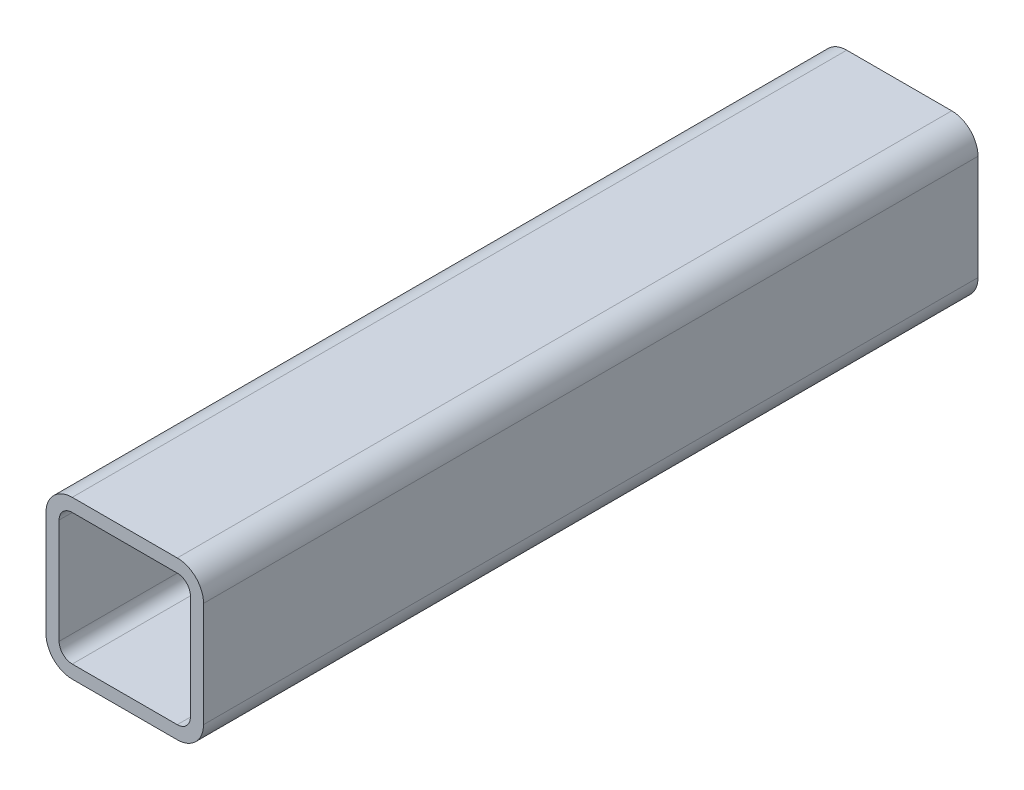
ISO-10303-21;
HEADER;
FILE_DESCRIPTION(('STEP AP214'),'2;1');
FILE_NAME('part.step','',(''),(''),'','','');
FILE_SCHEMA(('AUTOMOTIVE_DESIGN { 1 0 10303 214 1 1 1 1 }'));
ENDSEC;
DATA;
#1=APPLICATION_CONTEXT('core data for automotive mechanical design processes');
#2=APPLICATION_PROTOCOL_DEFINITION('international standard','automotive_design',2000,#1);
#3=PRODUCT_CONTEXT('',#1,'mechanical');
#4=PRODUCT('Part','Part','',(#3));
#5=PRODUCT_RELATED_PRODUCT_CATEGORY('part','',(#4));
#6=PRODUCT_DEFINITION_FORMATION('','',#4);
#7=PRODUCT_DEFINITION_CONTEXT('part definition',#1,'design');
#8=PRODUCT_DEFINITION('design','',#6,#7);
#9=PRODUCT_DEFINITION_SHAPE('','',#8);
#10=(LENGTH_UNIT() NAMED_UNIT(*) SI_UNIT(.MILLI.,.METRE.));
#11=(NAMED_UNIT(*) PLANE_ANGLE_UNIT() SI_UNIT($,.RADIAN.));
#12=(NAMED_UNIT(*) SI_UNIT($,.STERADIAN.) SOLID_ANGLE_UNIT());
#13=UNCERTAINTY_MEASURE_WITH_UNIT(LENGTH_MEASURE(1.E-05),#10,'distance_accuracy_value','');
#14=(GEOMETRIC_REPRESENTATION_CONTEXT(3) GLOBAL_UNCERTAINTY_ASSIGNED_CONTEXT((#13)) GLOBAL_UNIT_ASSIGNED_CONTEXT((#10,
#11,#12)) REPRESENTATION_CONTEXT('',''));
#15=CARTESIAN_POINT('',(0.,0.,0.));
#16=DIRECTION('',(0.,0.,1.));
#17=DIRECTION('',(1.,0.,0.));
#18=AXIS2_PLACEMENT_3D('',#15,#16,#17);
#19=CARTESIAN_POINT('',(-25.4,25.4,374.65));
#20=DIRECTION('',(0.,0.,-1.));
#21=DIRECTION('',(-1.,0.,0.));
#22=AXIS2_PLACEMENT_3D('',#19,#20,#21);
#23=CYLINDRICAL_SURFACE('',#22,12.7);
#24=CARTESIAN_POINT('',(-25.4,25.4,0.));
#25=DIRECTION('',(0.,0.,-1.));
#26=DIRECTION('',(-1.,0.,0.));
#27=AXIS2_PLACEMENT_3D('',#24,#25,#26);
#28=CIRCLE('',#27,12.7);
#29=CARTESIAN_POINT('',(-38.1,25.4,0.));
#30=VERTEX_POINT('',#29);
#31=CARTESIAN_POINT('',(-25.4,38.1,0.));
#32=VERTEX_POINT('',#31);
#33=EDGE_CURVE('E199',#30,#32,#28,.T.);
#34=ORIENTED_EDGE('',*,*,#33,.F.);
#35=DIRECTION('',(0.,0.,-1.));
#36=VECTOR('',#35,1.);
#37=CARTESIAN_POINT('',(-38.1,25.4,374.65));
#38=LINE('',#37,#36);
#39=CARTESIAN_POINT('',(-38.1,25.4,374.65));
#40=VERTEX_POINT('',#39);
#41=EDGE_CURVE('E11',#40,#30,#38,.T.);
#42=ORIENTED_EDGE('',*,*,#41,.F.);
#43=CARTESIAN_POINT('',(-25.4,25.4,374.65));
#44=DIRECTION('',(0.,0.,-1.));
#45=DIRECTION('',(-1.,0.,0.));
#46=AXIS2_PLACEMENT_3D('',#43,#44,#45);
#47=CIRCLE('',#46,12.7);
#48=CARTESIAN_POINT('',(-25.4,38.1,374.65));
#49=VERTEX_POINT('',#48);
#50=EDGE_CURVE('E211',#40,#49,#47,.T.);
#51=ORIENTED_EDGE('',*,*,#50,.T.);
#52=DIRECTION('',(0.,0.,-1.));
#53=VECTOR('',#52,1.);
#54=CARTESIAN_POINT('',(-25.4,38.1,374.65));
#55=LINE('',#54,#53);
#56=EDGE_CURVE('E35',#49,#32,#55,.T.);
#57=ORIENTED_EDGE('',*,*,#56,.T.);
#58=EDGE_LOOP('',(#34,#42,#51,#57));
#59=FACE_BOUND('',#58,.T.);
#60=ADVANCED_FACE('F32',(#59),#23,.T.);
#61=CARTESIAN_POINT('',(-38.1,25.4,374.65));
#62=DIRECTION('',(1.,0.,0.));
#63=DIRECTION('',(0.,0.,-1.));
#64=AXIS2_PLACEMENT_3D('',#61,#62,#63);
#65=PLANE('',#64);
#66=DIRECTION('',(0.,-1.,0.));
#67=VECTOR('',#66,1.);
#68=CARTESIAN_POINT('',(-38.1,25.4,0.));
#69=LINE('',#68,#67);
#70=CARTESIAN_POINT('',(-38.1,-25.4,0.));
#71=VERTEX_POINT('',#70);
#72=EDGE_CURVE('E215',#30,#71,#69,.T.);
#73=ORIENTED_EDGE('',*,*,#72,.T.);
#74=DIRECTION('',(0.,0.,-1.));
#75=VECTOR('',#74,1.);
#76=CARTESIAN_POINT('',(-38.1,-25.4,374.65));
#77=LINE('',#76,#75);
#78=CARTESIAN_POINT('',(-38.1,-25.4,374.65));
#79=VERTEX_POINT('',#78);
#80=EDGE_CURVE('E40',#79,#71,#77,.T.);
#81=ORIENTED_EDGE('',*,*,#80,.F.);
#82=DIRECTION('',(0.,-1.,0.));
#83=VECTOR('',#82,1.);
#84=CARTESIAN_POINT('',(-38.1,25.4,374.65));
#85=LINE('',#84,#83);
#86=EDGE_CURVE('E231',#40,#79,#85,.T.);
#87=ORIENTED_EDGE('',*,*,#86,.F.);
#88=ORIENTED_EDGE('',*,*,#41,.T.);
#89=EDGE_LOOP('',(#73,#81,#87,#88));
#90=FACE_BOUND('',#89,.T.);
#91=ADVANCED_FACE('F279',(#90),#65,.F.);
#92=CARTESIAN_POINT('',(-25.4,-25.4,374.65));
#93=DIRECTION('',(0.,0.,-1.));
#94=DIRECTION('',(-1.,0.,0.));
#95=AXIS2_PLACEMENT_3D('',#92,#93,#94);
#96=CYLINDRICAL_SURFACE('',#95,12.7);
#97=CARTESIAN_POINT('',(-25.4,-25.4,0.));
#98=DIRECTION('',(0.,0.,-1.));
#99=DIRECTION('',(-1.,0.,0.));
#100=AXIS2_PLACEMENT_3D('',#97,#98,#99);
#101=CIRCLE('',#100,12.7);
#102=CARTESIAN_POINT('',(-25.4,-38.1,0.));
#103=VERTEX_POINT('',#102);
#104=EDGE_CURVE('E249',#103,#71,#101,.T.);
#105=ORIENTED_EDGE('',*,*,#104,.F.);
#106=DIRECTION('',(0.,0.,-1.));
#107=VECTOR('',#106,1.);
#108=CARTESIAN_POINT('',(-25.4,-38.1,374.65));
#109=LINE('',#108,#107);
#110=CARTESIAN_POINT('',(-25.4,-38.1,374.65));
#111=VERTEX_POINT('',#110);
#112=EDGE_CURVE('E255',#111,#103,#109,.T.);
#113=ORIENTED_EDGE('',*,*,#112,.F.);
#114=CARTESIAN_POINT('',(-25.4,-25.4,374.65));
#115=DIRECTION('',(0.,0.,-1.));
#116=DIRECTION('',(-1.,0.,0.));
#117=AXIS2_PLACEMENT_3D('',#114,#115,#116);
#118=CIRCLE('',#117,12.7);
#119=EDGE_CURVE('E228',#111,#79,#118,.T.);
#120=ORIENTED_EDGE('',*,*,#119,.T.);
#121=ORIENTED_EDGE('',*,*,#80,.T.);
#122=EDGE_LOOP('',(#105,#113,#120,#121));
#123=FACE_BOUND('',#122,.T.);
#124=ADVANCED_FACE('F298',(#123),#96,.T.);
#125=CARTESIAN_POINT('',(25.4,-38.1,374.65));
#126=DIRECTION('',(0.,-1.,0.));
#127=DIRECTION('',(0.,0.,-1.));
#128=AXIS2_PLACEMENT_3D('',#125,#126,#127);
#129=PLANE('',#128);
#130=DIRECTION('',(-1.,0.,0.));
#131=VECTOR('',#130,1.);
#132=CARTESIAN_POINT('',(25.4,-38.1,0.));
#133=LINE('',#132,#131);
#134=CARTESIAN_POINT('',(25.4,-38.1,0.));
#135=VERTEX_POINT('',#134);
#136=EDGE_CURVE('E246',#135,#103,#133,.T.);
#137=ORIENTED_EDGE('',*,*,#136,.F.);
#138=DIRECTION('',(0.,0.,-1.));
#139=VECTOR('',#138,1.);
#140=CARTESIAN_POINT('',(25.4,-38.1,374.65));
#141=LINE('',#140,#139);
#142=CARTESIAN_POINT('',(25.4,-38.1,374.65));
#143=VERTEX_POINT('',#142);
#144=EDGE_CURVE('E257',#143,#135,#141,.T.);
#145=ORIENTED_EDGE('',*,*,#144,.F.);
#146=DIRECTION('',(-1.,0.,0.));
#147=VECTOR('',#146,1.);
#148=CARTESIAN_POINT('',(25.4,-38.1,374.65));
#149=LINE('',#148,#147);
#150=EDGE_CURVE('E225',#143,#111,#149,.T.);
#151=ORIENTED_EDGE('',*,*,#150,.T.);
#152=ORIENTED_EDGE('',*,*,#112,.T.);
#153=EDGE_LOOP('',(#137,#145,#151,#152));
#154=FACE_BOUND('',#153,.T.);
#155=ADVANCED_FACE('F296',(#154),#129,.T.);
#156=CARTESIAN_POINT('',(25.4,-25.4,374.65));
#157=DIRECTION('',(0.,0.,-1.));
#158=DIRECTION('',(-1.,0.,0.));
#159=AXIS2_PLACEMENT_3D('',#156,#157,#158);
#160=CYLINDRICAL_SURFACE('',#159,12.7);
#161=CARTESIAN_POINT('',(25.4,-25.4,0.));
#162=DIRECTION('',(0.,0.,-1.));
#163=DIRECTION('',(-1.,0.,0.));
#164=AXIS2_PLACEMENT_3D('',#161,#162,#163);
#165=CIRCLE('',#164,12.7);
#166=CARTESIAN_POINT('',(38.1,-25.4,0.));
#167=VERTEX_POINT('',#166);
#168=EDGE_CURVE('E243',#167,#135,#165,.T.);
#169=ORIENTED_EDGE('',*,*,#168,.F.);
#170=DIRECTION('',(0.,0.,-1.));
#171=VECTOR('',#170,1.);
#172=CARTESIAN_POINT('',(38.1,-25.4,374.65));
#173=LINE('',#172,#171);
#174=CARTESIAN_POINT('',(38.1,-25.4,374.65));
#175=VERTEX_POINT('',#174);
#176=EDGE_CURVE('E259',#175,#167,#173,.T.);
#177=ORIENTED_EDGE('',*,*,#176,.F.);
#178=CARTESIAN_POINT('',(25.4,-25.4,374.65));
#179=DIRECTION('',(0.,0.,-1.));
#180=DIRECTION('',(-1.,0.,0.));
#181=AXIS2_PLACEMENT_3D('',#178,#179,#180);
#182=CIRCLE('',#181,12.7);
#183=EDGE_CURVE('E222',#175,#143,#182,.T.);
#184=ORIENTED_EDGE('',*,*,#183,.T.);
#185=ORIENTED_EDGE('',*,*,#144,.T.);
#186=EDGE_LOOP('',(#169,#177,#184,#185));
#187=FACE_BOUND('',#186,.T.);
#188=ADVANCED_FACE('F292',(#187),#160,.T.);
#189=CARTESIAN_POINT('',(38.1,-25.4,374.65));
#190=DIRECTION('',(-1.,0.,0.));
#191=DIRECTION('',(0.,0.,1.));
#192=AXIS2_PLACEMENT_3D('',#189,#190,#191);
#193=PLANE('',#192);
#194=DIRECTION('',(0.,1.,0.));
#195=VECTOR('',#194,1.);
#196=CARTESIAN_POINT('',(38.1,-25.4,0.));
#197=LINE('',#196,#195);
#198=CARTESIAN_POINT('',(38.1,25.4,0.));
#199=VERTEX_POINT('',#198);
#200=EDGE_CURVE('E241',#167,#199,#197,.T.);
#201=ORIENTED_EDGE('',*,*,#200,.T.);
#202=DIRECTION('',(0.,0.,-1.));
#203=VECTOR('',#202,1.);
#204=CARTESIAN_POINT('',(38.1,25.4,374.65));
#205=LINE('',#204,#203);
#206=CARTESIAN_POINT('',(38.1,25.4,374.65));
#207=VERTEX_POINT('',#206);
#208=EDGE_CURVE('E261',#207,#199,#205,.T.);
#209=ORIENTED_EDGE('',*,*,#208,.F.);
#210=DIRECTION('',(0.,1.,0.));
#211=VECTOR('',#210,1.);
#212=CARTESIAN_POINT('',(38.1,-25.4,374.65));
#213=LINE('',#212,#211);
#214=EDGE_CURVE('E220',#175,#207,#213,.T.);
#215=ORIENTED_EDGE('',*,*,#214,.F.);
#216=ORIENTED_EDGE('',*,*,#176,.T.);
#217=EDGE_LOOP('',(#201,#209,#215,#216));
#218=FACE_BOUND('',#217,.T.);
#219=ADVANCED_FACE('F333',(#218),#193,.F.);
#220=CARTESIAN_POINT('',(25.4,25.4,374.65));
#221=DIRECTION('',(0.,0.,-1.));
#222=DIRECTION('',(-1.,0.,0.));
#223=AXIS2_PLACEMENT_3D('',#220,#221,#222);
#224=CYLINDRICAL_SURFACE('',#223,12.7);
#225=CARTESIAN_POINT('',(25.4,25.4,0.));
#226=DIRECTION('',(0.,0.,1.));
#227=DIRECTION('',(1.,0.,0.));
#228=AXIS2_PLACEMENT_3D('',#225,#226,#227);
#229=CIRCLE('',#228,12.7);
#230=CARTESIAN_POINT('',(25.4,38.1,0.));
#231=VERTEX_POINT('',#230);
#232=EDGE_CURVE('E238',#199,#231,#229,.T.);
#233=ORIENTED_EDGE('',*,*,#232,.T.);
#234=DIRECTION('',(0.,0.,-1.));
#235=VECTOR('',#234,1.);
#236=CARTESIAN_POINT('',(25.4,38.1,374.65));
#237=LINE('',#236,#235);
#238=CARTESIAN_POINT('',(25.4,38.1,374.65));
#239=VERTEX_POINT('',#238);
#240=EDGE_CURVE('E263',#239,#231,#237,.T.);
#241=ORIENTED_EDGE('',*,*,#240,.F.);
#242=CARTESIAN_POINT('',(25.4,25.4,374.65));
#243=DIRECTION('',(0.,0.,1.));
#244=DIRECTION('',(1.,0.,0.));
#245=AXIS2_PLACEMENT_3D('',#242,#243,#244);
#246=CIRCLE('',#245,12.7);
#247=EDGE_CURVE('E218',#207,#239,#246,.T.);
#248=ORIENTED_EDGE('',*,*,#247,.F.);
#249=ORIENTED_EDGE('',*,*,#208,.T.);
#250=EDGE_LOOP('',(#233,#241,#248,#249));
#251=FACE_BOUND('',#250,.T.);
#252=ADVANCED_FACE('F287',(#251),#224,.T.);
#253=CARTESIAN_POINT('',(-25.4,38.1,374.65));
#254=DIRECTION('',(0.,1.,0.));
#255=DIRECTION('',(0.,0.,1.));
#256=AXIS2_PLACEMENT_3D('',#253,#254,#255);
#257=PLANE('',#256);
#258=DIRECTION('',(1.,0.,0.));
#259=VECTOR('',#258,1.);
#260=CARTESIAN_POINT('',(-25.4,38.1,0.));
#261=LINE('',#260,#259);
#262=EDGE_CURVE('E235',#32,#231,#261,.T.);
#263=ORIENTED_EDGE('',*,*,#262,.F.);
#264=ORIENTED_EDGE('',*,*,#56,.F.);
#265=DIRECTION('',(1.,0.,0.));
#266=VECTOR('',#265,1.);
#267=CARTESIAN_POINT('',(-25.4,38.1,374.65));
#268=LINE('',#267,#266);
#269=EDGE_CURVE('E214',#49,#239,#268,.T.);
#270=ORIENTED_EDGE('',*,*,#269,.T.);
#271=ORIENTED_EDGE('',*,*,#240,.T.);
#272=EDGE_LOOP('',(#263,#264,#270,#271));
#273=FACE_BOUND('',#272,.T.);
#274=ADVANCED_FACE('F271',(#273),#257,.T.);
#275=CARTESIAN_POINT('',(-25.4,25.4,374.65));
#276=DIRECTION('',(0.,0.,-1.));
#277=DIRECTION('',(-1.,0.,0.));
#278=AXIS2_PLACEMENT_3D('',#275,#276,#277);
#279=PLANE('',#278);
#280=DIRECTION('',(0.,-1.,0.));
#281=VECTOR('',#280,1.);
#282=CARTESIAN_POINT('',(-31.75,25.4,374.65));
#283=LINE('',#282,#281);
#284=CARTESIAN_POINT('',(-31.75,25.4,374.65));
#285=VERTEX_POINT('',#284);
#286=CARTESIAN_POINT('',(-31.75,-25.4,374.65));
#287=VERTEX_POINT('',#286);
#288=EDGE_CURVE('E150',#285,#287,#283,.T.);
#289=ORIENTED_EDGE('',*,*,#288,.F.);
#290=CARTESIAN_POINT('',(-25.4,25.4,374.65));
#291=DIRECTION('',(0.,0.,-1.));
#292=DIRECTION('',(-1.,0.,0.));
#293=AXIS2_PLACEMENT_3D('',#290,#291,#292);
#294=CIRCLE('',#293,6.35000000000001);
#295=CARTESIAN_POINT('',(-25.4,31.75,374.65));
#296=VERTEX_POINT('',#295);
#297=EDGE_CURVE('E147',#285,#296,#294,.T.);
#298=ORIENTED_EDGE('',*,*,#297,.T.);
#299=DIRECTION('',(1.,0.,0.));
#300=VECTOR('',#299,1.);
#301=CARTESIAN_POINT('',(-25.4,31.75,374.65));
#302=LINE('',#301,#300);
#303=CARTESIAN_POINT('',(25.4,31.75,374.65));
#304=VERTEX_POINT('',#303);
#305=EDGE_CURVE('E153',#296,#304,#302,.T.);
#306=ORIENTED_EDGE('',*,*,#305,.T.);
#307=CARTESIAN_POINT('',(25.4,25.4,374.65));
#308=DIRECTION('',(0.,0.,-1.));
#309=DIRECTION('',(-1.,0.,0.));
#310=AXIS2_PLACEMENT_3D('',#307,#308,#309);
#311=CIRCLE('',#310,6.35000000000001);
#312=CARTESIAN_POINT('',(31.75,25.4,374.65));
#313=VERTEX_POINT('',#312);
#314=EDGE_CURVE('E157',#313,#304,#311,.F.);
#315=ORIENTED_EDGE('',*,*,#314,.F.);
#316=DIRECTION('',(0.,1.,0.));
#317=VECTOR('',#316,1.);
#318=CARTESIAN_POINT('',(31.75,25.4,374.65));
#319=LINE('',#318,#317);
#320=CARTESIAN_POINT('',(31.75,-25.4,374.65));
#321=VERTEX_POINT('',#320);
#322=EDGE_CURVE('E169',#321,#313,#319,.T.);
#323=ORIENTED_EDGE('',*,*,#322,.F.);
#324=CARTESIAN_POINT('',(25.4,-25.4,374.65));
#325=DIRECTION('',(0.,0.,-1.));
#326=DIRECTION('',(-1.,0.,0.));
#327=AXIS2_PLACEMENT_3D('',#324,#325,#326);
#328=CIRCLE('',#327,6.35000000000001);
#329=CARTESIAN_POINT('',(25.4,-31.75,374.65));
#330=VERTEX_POINT('',#329);
#331=EDGE_CURVE('E171',#321,#330,#328,.T.);
#332=ORIENTED_EDGE('',*,*,#331,.T.);
#333=DIRECTION('',(-1.,0.,0.));
#334=VECTOR('',#333,1.);
#335=CARTESIAN_POINT('',(-25.4,-31.75,374.65));
#336=LINE('',#335,#334);
#337=CARTESIAN_POINT('',(-25.4,-31.75,374.65));
#338=VERTEX_POINT('',#337);
#339=EDGE_CURVE('E174',#330,#338,#336,.T.);
#340=ORIENTED_EDGE('',*,*,#339,.T.);
#341=CARTESIAN_POINT('',(-25.4,-25.4,374.65));
#342=DIRECTION('',(0.,0.,-1.));
#343=DIRECTION('',(-1.,0.,0.));
#344=AXIS2_PLACEMENT_3D('',#341,#342,#343);
#345=CIRCLE('',#344,6.35000000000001);
#346=EDGE_CURVE('E177',#338,#287,#345,.T.);
#347=ORIENTED_EDGE('',*,*,#346,.T.);
#348=EDGE_LOOP('',(#289,#298,#306,#315,#323,#332,#340,#347));
#349=FACE_BOUND('',#348,.T.);
#350=ORIENTED_EDGE('',*,*,#50,.F.);
#351=ORIENTED_EDGE('',*,*,#86,.T.);
#352=ORIENTED_EDGE('',*,*,#119,.F.);
#353=ORIENTED_EDGE('',*,*,#150,.F.);
#354=ORIENTED_EDGE('',*,*,#183,.F.);
#355=ORIENTED_EDGE('',*,*,#214,.T.);
#356=ORIENTED_EDGE('',*,*,#247,.T.);
#357=ORIENTED_EDGE('',*,*,#269,.F.);
#358=EDGE_LOOP('',(#350,#351,#352,#353,#354,#355,#356,#357));
#359=FACE_BOUND('',#358,.T.);
#360=ADVANCED_FACE('F159',(#349,#359),#279,.F.);
#361=CARTESIAN_POINT('',(-25.4,25.4,0.));
#362=DIRECTION('',(0.,0.,-1.));
#363=DIRECTION('',(-1.,0.,0.));
#364=AXIS2_PLACEMENT_3D('',#361,#362,#363);
#365=PLANE('',#364);
#366=CARTESIAN_POINT('',(-25.4,25.4,0.));
#367=DIRECTION('',(0.,0.,-1.));
#368=DIRECTION('',(-1.,0.,0.));
#369=AXIS2_PLACEMENT_3D('',#366,#367,#368);
#370=CIRCLE('',#369,6.35000000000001);
#371=CARTESIAN_POINT('',(-31.75,25.4,0.));
#372=VERTEX_POINT('',#371);
#373=CARTESIAN_POINT('',(-25.4,31.75,0.));
#374=VERTEX_POINT('',#373);
#375=EDGE_CURVE('E56',#372,#374,#370,.T.);
#376=ORIENTED_EDGE('',*,*,#375,.F.);
#377=DIRECTION('',(0.,-1.,0.));
#378=VECTOR('',#377,1.);
#379=CARTESIAN_POINT('',(-31.75,25.4,0.));
#380=LINE('',#379,#378);
#381=CARTESIAN_POINT('',(-31.75,-25.4,0.));
#382=VERTEX_POINT('',#381);
#383=EDGE_CURVE('E162',#372,#382,#380,.T.);
#384=ORIENTED_EDGE('',*,*,#383,.T.);
#385=CARTESIAN_POINT('',(-25.4,-25.4,0.));
#386=DIRECTION('',(0.,0.,-1.));
#387=DIRECTION('',(-1.,0.,0.));
#388=AXIS2_PLACEMENT_3D('',#385,#386,#387);
#389=CIRCLE('',#388,6.35000000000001);
#390=CARTESIAN_POINT('',(-25.4,-31.75,0.));
#391=VERTEX_POINT('',#390);
#392=EDGE_CURVE('E165',#391,#382,#389,.T.);
#393=ORIENTED_EDGE('',*,*,#392,.F.);
#394=DIRECTION('',(-1.,0.,0.));
#395=VECTOR('',#394,1.);
#396=CARTESIAN_POINT('',(-25.4,-31.75,0.));
#397=LINE('',#396,#395);
#398=CARTESIAN_POINT('',(25.4,-31.75,0.));
#399=VERTEX_POINT('',#398);
#400=EDGE_CURVE('E192',#399,#391,#397,.T.);
#401=ORIENTED_EDGE('',*,*,#400,.F.);
#402=CARTESIAN_POINT('',(25.4,-25.4,0.));
#403=DIRECTION('',(0.,0.,-1.));
#404=DIRECTION('',(-1.,0.,0.));
#405=AXIS2_PLACEMENT_3D('',#402,#403,#404);
#406=CIRCLE('',#405,6.35000000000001);
#407=CARTESIAN_POINT('',(31.75,-25.4,0.));
#408=VERTEX_POINT('',#407);
#409=EDGE_CURVE('E189',#408,#399,#406,.T.);
#410=ORIENTED_EDGE('',*,*,#409,.F.);
#411=DIRECTION('',(0.,1.,0.));
#412=VECTOR('',#411,1.);
#413=CARTESIAN_POINT('',(31.75,25.4,0.));
#414=LINE('',#413,#412);
#415=CARTESIAN_POINT('',(31.75,25.4,0.));
#416=VERTEX_POINT('',#415);
#417=EDGE_CURVE('E186',#408,#416,#414,.T.);
#418=ORIENTED_EDGE('',*,*,#417,.T.);
#419=CARTESIAN_POINT('',(25.4,25.4,0.));
#420=DIRECTION('',(0.,0.,-1.));
#421=DIRECTION('',(-1.,0.,0.));
#422=AXIS2_PLACEMENT_3D('',#419,#420,#421);
#423=CIRCLE('',#422,6.35000000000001);
#424=CARTESIAN_POINT('',(25.4,31.75,0.));
#425=VERTEX_POINT('',#424);
#426=EDGE_CURVE('E183',#416,#425,#423,.F.);
#427=ORIENTED_EDGE('',*,*,#426,.T.);
#428=DIRECTION('',(1.,0.,0.));
#429=VECTOR('',#428,1.);
#430=CARTESIAN_POINT('',(-25.4,31.75,0.));
#431=LINE('',#430,#429);
#432=EDGE_CURVE('E181',#374,#425,#431,.T.);
#433=ORIENTED_EDGE('',*,*,#432,.F.);
#434=EDGE_LOOP('',(#376,#384,#393,#401,#410,#418,#427,#433));
#435=FACE_BOUND('',#434,.T.);
#436=ORIENTED_EDGE('',*,*,#33,.T.);
#437=ORIENTED_EDGE('',*,*,#262,.T.);
#438=ORIENTED_EDGE('',*,*,#232,.F.);
#439=ORIENTED_EDGE('',*,*,#200,.F.);
#440=ORIENTED_EDGE('',*,*,#168,.T.);
#441=ORIENTED_EDGE('',*,*,#136,.T.);
#442=ORIENTED_EDGE('',*,*,#104,.T.);
#443=ORIENTED_EDGE('',*,*,#72,.F.);
#444=EDGE_LOOP('',(#436,#437,#438,#439,#440,#441,#442,#443));
#445=FACE_BOUND('',#444,.T.);
#446=ADVANCED_FACE('F275',(#435,#445),#365,.T.);
#447=CARTESIAN_POINT('',(-25.4,25.4,374.65));
#448=DIRECTION('',(0.,0.,-1.));
#449=DIRECTION('',(-1.,0.,0.));
#450=AXIS2_PLACEMENT_3D('',#447,#448,#449);
#451=CYLINDRICAL_SURFACE('',#450,6.35000000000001);
#452=ORIENTED_EDGE('',*,*,#375,.T.);
#453=DIRECTION('',(0.,0.,-1.));
#454=VECTOR('',#453,1.);
#455=CARTESIAN_POINT('',(-25.4,31.75,374.65));
#456=LINE('',#455,#454);
#457=EDGE_CURVE('E144',#296,#374,#456,.T.);
#458=ORIENTED_EDGE('',*,*,#457,.F.);
#459=ORIENTED_EDGE('',*,*,#297,.F.);
#460=DIRECTION('',(0.,0.,-1.));
#461=VECTOR('',#460,1.);
#462=CARTESIAN_POINT('',(-31.75,25.4,374.65));
#463=LINE('',#462,#461);
#464=EDGE_CURVE('E197',#285,#372,#463,.T.);
#465=ORIENTED_EDGE('',*,*,#464,.T.);
#466=EDGE_LOOP('',(#452,#458,#459,#465));
#467=FACE_BOUND('',#466,.T.);
#468=ADVANCED_FACE('F145',(#467),#451,.F.);
#469=CARTESIAN_POINT('',(-31.75,25.4,374.65));
#470=DIRECTION('',(1.,0.,0.));
#471=DIRECTION('',(0.,0.,-1.));
#472=AXIS2_PLACEMENT_3D('',#469,#470,#471);
#473=PLANE('',#472);
#474=ORIENTED_EDGE('',*,*,#383,.F.);
#475=ORIENTED_EDGE('',*,*,#464,.F.);
#476=ORIENTED_EDGE('',*,*,#288,.T.);
#477=DIRECTION('',(0.,0.,-1.));
#478=VECTOR('',#477,1.);
#479=CARTESIAN_POINT('',(-31.75,-25.4,374.65));
#480=LINE('',#479,#478);
#481=EDGE_CURVE('E200',#287,#382,#480,.T.);
#482=ORIENTED_EDGE('',*,*,#481,.T.);
#483=EDGE_LOOP('',(#474,#475,#476,#482));
#484=FACE_BOUND('',#483,.T.);
#485=ADVANCED_FACE('F382',(#484),#473,.T.);
#486=CARTESIAN_POINT('',(-25.4,-25.4,374.65));
#487=DIRECTION('',(0.,0.,-1.));
#488=DIRECTION('',(-1.,0.,0.));
#489=AXIS2_PLACEMENT_3D('',#486,#487,#488);
#490=CYLINDRICAL_SURFACE('',#489,6.35000000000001);
#491=ORIENTED_EDGE('',*,*,#392,.T.);
#492=ORIENTED_EDGE('',*,*,#481,.F.);
#493=ORIENTED_EDGE('',*,*,#346,.F.);
#494=DIRECTION('',(0.,0.,-1.));
#495=VECTOR('',#494,1.);
#496=CARTESIAN_POINT('',(-25.4,-31.75,374.65));
#497=LINE('',#496,#495);
#498=EDGE_CURVE('E202',#338,#391,#497,.T.);
#499=ORIENTED_EDGE('',*,*,#498,.T.);
#500=EDGE_LOOP('',(#491,#492,#493,#499));
#501=FACE_BOUND('',#500,.T.);
#502=ADVANCED_FACE('F391',(#501),#490,.F.);
#503=CARTESIAN_POINT('',(-25.4,-31.75,374.65));
#504=DIRECTION('',(0.,-1.,0.));
#505=DIRECTION('',(0.,0.,-1.));
#506=AXIS2_PLACEMENT_3D('',#503,#504,#505);
#507=PLANE('',#506);
#508=ORIENTED_EDGE('',*,*,#400,.T.);
#509=ORIENTED_EDGE('',*,*,#498,.F.);
#510=ORIENTED_EDGE('',*,*,#339,.F.);
#511=DIRECTION('',(0.,0.,-1.));
#512=VECTOR('',#511,1.);
#513=CARTESIAN_POINT('',(25.4,-31.75,374.65));
#514=LINE('',#513,#512);
#515=EDGE_CURVE('E204',#330,#399,#514,.T.);
#516=ORIENTED_EDGE('',*,*,#515,.T.);
#517=EDGE_LOOP('',(#508,#509,#510,#516));
#518=FACE_BOUND('',#517,.T.);
#519=ADVANCED_FACE('F401',(#518),#507,.F.);
#520=CARTESIAN_POINT('',(25.4,-25.4,374.65));
#521=DIRECTION('',(0.,0.,-1.));
#522=DIRECTION('',(-1.,0.,0.));
#523=AXIS2_PLACEMENT_3D('',#520,#521,#522);
#524=CYLINDRICAL_SURFACE('',#523,6.35000000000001);
#525=ORIENTED_EDGE('',*,*,#409,.T.);
#526=ORIENTED_EDGE('',*,*,#515,.F.);
#527=ORIENTED_EDGE('',*,*,#331,.F.);
#528=DIRECTION('',(0.,0.,-1.));
#529=VECTOR('',#528,1.);
#530=CARTESIAN_POINT('',(31.75,-25.4,374.65));
#531=LINE('',#530,#529);
#532=EDGE_CURVE('E206',#321,#408,#531,.T.);
#533=ORIENTED_EDGE('',*,*,#532,.T.);
#534=EDGE_LOOP('',(#525,#526,#527,#533));
#535=FACE_BOUND('',#534,.T.);
#536=ADVANCED_FACE('F411',(#535),#524,.F.);
#537=CARTESIAN_POINT('',(31.75,25.4,374.65));
#538=DIRECTION('',(-1.,0.,0.));
#539=DIRECTION('',(0.,0.,1.));
#540=AXIS2_PLACEMENT_3D('',#537,#538,#539);
#541=PLANE('',#540);
#542=ORIENTED_EDGE('',*,*,#417,.F.);
#543=ORIENTED_EDGE('',*,*,#532,.F.);
#544=ORIENTED_EDGE('',*,*,#322,.T.);
#545=DIRECTION('',(0.,0.,-1.));
#546=VECTOR('',#545,1.);
#547=CARTESIAN_POINT('',(31.75,25.4,374.65));
#548=LINE('',#547,#546);
#549=EDGE_CURVE('E208',#313,#416,#548,.T.);
#550=ORIENTED_EDGE('',*,*,#549,.T.);
#551=EDGE_LOOP('',(#542,#543,#544,#550));
#552=FACE_BOUND('',#551,.T.);
#553=ADVANCED_FACE('F421',(#552),#541,.T.);
#554=CARTESIAN_POINT('',(25.4,25.4,374.65));
#555=DIRECTION('',(0.,0.,-1.));
#556=DIRECTION('',(-1.,0.,0.));
#557=AXIS2_PLACEMENT_3D('',#554,#555,#556);
#558=CYLINDRICAL_SURFACE('',#557,6.35000000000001);
#559=ORIENTED_EDGE('',*,*,#426,.F.);
#560=ORIENTED_EDGE('',*,*,#549,.F.);
#561=ORIENTED_EDGE('',*,*,#314,.T.);
#562=DIRECTION('',(0.,0.,-1.));
#563=VECTOR('',#562,1.);
#564=CARTESIAN_POINT('',(25.4,31.75,374.65));
#565=LINE('',#564,#563);
#566=EDGE_CURVE('E48',#304,#425,#565,.T.);
#567=ORIENTED_EDGE('',*,*,#566,.T.);
#568=EDGE_LOOP('',(#559,#560,#561,#567));
#569=FACE_BOUND('',#568,.T.);
#570=ADVANCED_FACE('F431',(#569),#558,.F.);
#571=CARTESIAN_POINT('',(-25.4,31.75,374.65));
#572=DIRECTION('',(0.,1.,0.));
#573=DIRECTION('',(0.,0.,1.));
#574=AXIS2_PLACEMENT_3D('',#571,#572,#573);
#575=PLANE('',#574);
#576=ORIENTED_EDGE('',*,*,#432,.T.);
#577=ORIENTED_EDGE('',*,*,#566,.F.);
#578=ORIENTED_EDGE('',*,*,#305,.F.);
#579=ORIENTED_EDGE('',*,*,#457,.T.);
#580=EDGE_LOOP('',(#576,#577,#578,#579));
#581=FACE_BOUND('',#580,.T.);
#582=ADVANCED_FACE('F154',(#581),#575,.F.);
#583=CLOSED_SHELL('',(#60,#91,#124,#155,#188,#219,#252,#274,#360,#446,#468,#485,#502,#519,#536,
#553,#570,#582));
#584=MANIFOLD_SOLID_BREP('B2',#583);
#585=ADVANCED_BREP_SHAPE_REPRESENTATION('',(#18,#584),#14);
#586=SHAPE_DEFINITION_REPRESENTATION(#9,#585);
ENDSEC;
END-ISO-10303-21;
